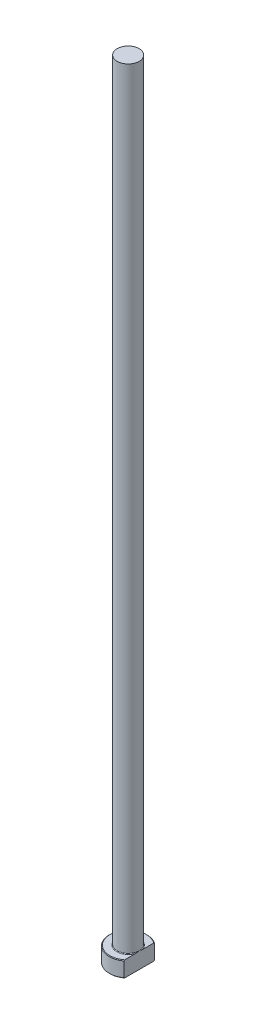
ISO-10303-21;
HEADER;
FILE_DESCRIPTION(('STEP AP214'),'2;1');
FILE_NAME('part.step','',(''),(''),'','','');
FILE_SCHEMA(('AUTOMOTIVE_DESIGN { 1 0 10303 214 1 1 1 1 }'));
ENDSEC;
DATA;
#1=APPLICATION_CONTEXT('core data for automotive mechanical design processes');
#2=APPLICATION_PROTOCOL_DEFINITION('international standard','automotive_design',2000,#1);
#3=PRODUCT_CONTEXT('',#1,'mechanical');
#4=PRODUCT('Part','Part','',(#3));
#5=PRODUCT_RELATED_PRODUCT_CATEGORY('part','',(#4));
#6=PRODUCT_DEFINITION_FORMATION('','',#4);
#7=PRODUCT_DEFINITION_CONTEXT('part definition',#1,'design');
#8=PRODUCT_DEFINITION('design','',#6,#7);
#9=PRODUCT_DEFINITION_SHAPE('','',#8);
#10=(LENGTH_UNIT() NAMED_UNIT(*) SI_UNIT(.MILLI.,.METRE.));
#11=(NAMED_UNIT(*) PLANE_ANGLE_UNIT() SI_UNIT($,.RADIAN.));
#12=(NAMED_UNIT(*) SI_UNIT($,.STERADIAN.) SOLID_ANGLE_UNIT());
#13=UNCERTAINTY_MEASURE_WITH_UNIT(LENGTH_MEASURE(1.E-05),#10,'distance_accuracy_value','');
#14=(GEOMETRIC_REPRESENTATION_CONTEXT(3) GLOBAL_UNCERTAINTY_ASSIGNED_CONTEXT((#13)) GLOBAL_UNIT_ASSIGNED_CONTEXT((#10,
#11,#12)) REPRESENTATION_CONTEXT('',''));
#15=CARTESIAN_POINT('',(0.,0.,0.));
#16=DIRECTION('',(0.,0.,1.));
#17=DIRECTION('',(1.,0.,0.));
#18=AXIS2_PLACEMENT_3D('',#15,#16,#17);
#19=CARTESIAN_POINT('',(0.,0.,0.));
#20=DIRECTION('',(0.,-1.,0.));
#21=DIRECTION('',(0.,0.,-1.));
#22=AXIS2_PLACEMENT_3D('',#19,#20,#21);
#23=PLANE('',#22);
#24=CARTESIAN_POINT('',(0.,0.,0.));
#25=DIRECTION('',(0.,-1.,0.));
#26=DIRECTION('',(0.,0.,-1.));
#27=AXIS2_PLACEMENT_3D('',#24,#25,#26);
#28=CIRCLE('',#27,5.79999999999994);
#29=CARTESIAN_POINT('',(3.49999999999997,0.,4.62493243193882));
#30=VERTEX_POINT('',#29);
#31=CARTESIAN_POINT('',(3.49999999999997,0.,-4.62493243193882));
#32=VERTEX_POINT('',#31);
#33=EDGE_CURVE('E98',#30,#32,#28,.T.);
#34=ORIENTED_EDGE('',*,*,#33,.T.);
#35=DIRECTION('',(0.,0.,1.));
#36=VECTOR('',#35,1.);
#37=CARTESIAN_POINT('',(3.49999999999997,0.,-4.87339717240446));
#38=LINE('',#37,#36);
#39=EDGE_CURVE('E83',#32,#30,#38,.T.);
#40=ORIENTED_EDGE('',*,*,#39,.T.);
#41=EDGE_LOOP('',(#34,#40));
#42=FACE_BOUND('',#41,.T.);
#43=ADVANCED_FACE('F32',(#42),#23,.T.);
#44=CARTESIAN_POINT('',(0.,259.958771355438,0.));
#45=DIRECTION('',(0.,1.,0.));
#46=DIRECTION('',(0.,0.,1.));
#47=AXIS2_PLACEMENT_3D('',#44,#45,#46);
#48=CYLINDRICAL_SURFACE('',#47,5.99999999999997);
#49=CARTESIAN_POINT('',(0.,4.80000000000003,0.));
#50=DIRECTION('',(0.,1.,0.));
#51=DIRECTION('',(0.,0.,1.));
#52=AXIS2_PLACEMENT_3D('',#49,#50,#51);
#53=CIRCLE('',#52,5.99999999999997);
#54=CARTESIAN_POINT('',(3.49999999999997,4.80000000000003,4.87339717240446));
#55=VERTEX_POINT('',#54);
#56=CARTESIAN_POINT('',(3.49999999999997,4.80000000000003,-4.87339717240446));
#57=VERTEX_POINT('',#56);
#58=EDGE_CURVE('E104',#55,#57,#53,.F.);
#59=ORIENTED_EDGE('',*,*,#58,.T.);
#60=DIRECTION('',(0.,-1.,0.));
#61=VECTOR('',#60,1.);
#62=CARTESIAN_POINT('',(3.49999999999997,250.,-4.87339717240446));
#63=LINE('',#62,#61);
#64=CARTESIAN_POINT('',(3.49999999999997,0.200000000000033,-4.87339717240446));
#65=VERTEX_POINT('',#64);
#66=EDGE_CURVE('E183',#57,#65,#63,.T.);
#67=ORIENTED_EDGE('',*,*,#66,.T.);
#68=CARTESIAN_POINT('',(0.,0.200000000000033,0.));
#69=DIRECTION('',(0.,-1.,0.));
#70=DIRECTION('',(0.,0.,-1.));
#71=AXIS2_PLACEMENT_3D('',#68,#69,#70);
#72=CIRCLE('',#71,5.99999999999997);
#73=CARTESIAN_POINT('',(3.49999999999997,0.200000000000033,4.87339717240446));
#74=VERTEX_POINT('',#73);
#75=EDGE_CURVE('E100',#65,#74,#72,.F.);
#76=ORIENTED_EDGE('',*,*,#75,.T.);
#77=DIRECTION('',(0.,-1.,0.));
#78=VECTOR('',#77,1.);
#79=CARTESIAN_POINT('',(3.49999999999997,250.,4.87339717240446));
#80=LINE('',#79,#78);
#81=EDGE_CURVE('E93',#55,#74,#80,.T.);
#82=ORIENTED_EDGE('',*,*,#81,.F.);
#83=EDGE_LOOP('',(#59,#67,#76,#82));
#84=FACE_BOUND('',#83,.T.);
#85=ADVANCED_FACE('F158',(#84),#48,.T.);
#86=CARTESIAN_POINT('',(-5.99999999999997,5.,0.));
#87=DIRECTION('',(0.,1.,0.));
#88=DIRECTION('',(0.,0.,1.));
#89=AXIS2_PLACEMENT_3D('',#86,#87,#88);
#90=PLANE('',#89);
#91=CARTESIAN_POINT('',(0.,5.,0.));
#92=DIRECTION('',(0.,1.,0.));
#93=DIRECTION('',(0.,0.,1.));
#94=AXIS2_PLACEMENT_3D('',#91,#92,#93);
#95=CIRCLE('',#94,5.79999999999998);
#96=CARTESIAN_POINT('',(3.49999999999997,5.,-4.62493243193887));
#97=VERTEX_POINT('',#96);
#98=CARTESIAN_POINT('',(3.49999999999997,5.,4.62493243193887));
#99=VERTEX_POINT('',#98);
#100=EDGE_CURVE('E178',#97,#99,#95,.T.);
#101=ORIENTED_EDGE('',*,*,#100,.T.);
#102=DIRECTION('',(0.,0.,-1.));
#103=VECTOR('',#102,1.);
#104=CARTESIAN_POINT('',(3.49999999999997,5.,0.));
#105=LINE('',#104,#103);
#106=CARTESIAN_POINT('',(3.49999999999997,4.99999999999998,1.19999999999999));
#107=VERTEX_POINT('',#106);
#108=EDGE_CURVE('E57',#99,#107,#105,.T.);
#109=ORIENTED_EDGE('',*,*,#108,.T.);
#110=CARTESIAN_POINT('',(0.,5.,0.));
#111=DIRECTION('',(0.,1.,0.));
#112=DIRECTION('',(0.,0.,1.));
#113=AXIS2_PLACEMENT_3D('',#110,#111,#112);
#114=CIRCLE('',#113,3.69999999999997);
#115=CARTESIAN_POINT('',(3.49999999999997,4.99999999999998,-1.19999999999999));
#116=VERTEX_POINT('',#115);
#117=EDGE_CURVE('E107',#107,#116,#114,.F.);
#118=ORIENTED_EDGE('',*,*,#117,.T.);
#119=EDGE_CURVE('E136',#116,#97,#105,.T.);
#120=ORIENTED_EDGE('',*,*,#119,.T.);
#121=EDGE_LOOP('',(#101,#109,#118,#120));
#122=FACE_BOUND('',#121,.T.);
#123=ADVANCED_FACE('F147',(#122),#90,.T.);
#124=CARTESIAN_POINT('',(0.,5.,0.));
#125=DIRECTION('',(0.,-1.,0.));
#126=DIRECTION('',(0.,0.,-1.));
#127=AXIS2_PLACEMENT_3D('',#124,#125,#126);
#128=CONICAL_SURFACE('',#127,5.79999999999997,0.785398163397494);
#129=ORIENTED_EDGE('',*,*,#58,.F.);
#130=CARTESIAN_POINT('',(3.49999999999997,-0.479658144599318,10.7229048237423));
#131=CARTESIAN_POINT('',(3.49999999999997,-0.304627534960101,10.5387821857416));
#132=CARTESIAN_POINT('',(3.49999999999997,-0.12982047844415,10.3544468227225));
#133=CARTESIAN_POINT('',(3.49999999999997,0.219261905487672,9.98527122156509));
#134=CARTESIAN_POINT('',(3.49999999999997,0.39353722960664,9.80043098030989));
#135=CARTESIAN_POINT('',(3.49999999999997,0.91559488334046,9.24486752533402));
#136=CARTESIAN_POINT('',(3.49999999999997,1.26244829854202,8.87327020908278));
#137=CARTESIAN_POINT('',(3.49999999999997,1.95718621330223,8.12195979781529));
#138=CARTESIAN_POINT('',(3.49999999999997,2.30502483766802,7.74220412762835));
#139=CARTESIAN_POINT('',(3.49999999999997,2.82267860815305,7.16898192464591));
#140=CARTESIAN_POINT('',(3.49999999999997,2.99451670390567,6.97734293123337));
#141=CARTESIAN_POINT('',(3.49999999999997,3.33649221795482,6.59255347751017));
#142=CARTESIAN_POINT('',(3.49999999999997,3.50662964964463,6.39940302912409));
#143=CARTESIAN_POINT('',(3.49999999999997,3.80984794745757,6.05127590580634));
#144=CARTESIAN_POINT('',(3.49999999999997,3.9433293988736,5.89664839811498));
#145=CARTESIAN_POINT('',(3.49999999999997,4.20861192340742,5.58595941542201));
#146=CARTESIAN_POINT('',(3.49999999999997,4.34041301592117,5.42989795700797));
#147=CARTESIAN_POINT('',(3.49999999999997,4.60204886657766,5.11587234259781));
#148=CARTESIAN_POINT('',(3.49999999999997,4.73188156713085,4.9579064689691));
#149=CARTESIAN_POINT('',(3.49999999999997,4.98887681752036,4.63982145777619));
#150=CARTESIAN_POINT('',(3.49999999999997,5.11603946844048,4.47970240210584));
#151=CARTESIAN_POINT('',(3.49999999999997,5.36664013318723,4.15712646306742));
#152=CARTESIAN_POINT('',(3.49999999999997,5.49008567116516,3.99467544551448));
#153=CARTESIAN_POINT('',(3.49999999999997,5.73245687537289,3.6663703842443));
#154=CARTESIAN_POINT('',(3.49999999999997,5.85138169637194,3.50051571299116));
#155=CARTESIAN_POINT('',(3.49999999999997,6.08288587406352,3.16479623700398));
#156=CARTESIAN_POINT('',(3.49999999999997,6.19547497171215,2.99493819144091));
#157=CARTESIAN_POINT('',(3.49999999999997,6.41208556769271,2.6498795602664));
#158=CARTESIAN_POINT('',(3.49999999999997,6.51611116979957,2.47468158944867));
#159=CARTESIAN_POINT('',(3.49999999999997,6.68667355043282,2.16371702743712));
#160=CARTESIAN_POINT('',(3.49999999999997,6.75595020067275,2.02946380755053));
#161=CARTESIAN_POINT('',(3.49999999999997,6.88572771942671,1.75668071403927));
#162=CARTESIAN_POINT('',(3.49999999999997,6.9462264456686,1.61814980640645));
#163=CARTESIAN_POINT('',(3.49999999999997,7.05535730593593,1.33751093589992));
#164=CARTESIAN_POINT('',(3.49999999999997,7.10406788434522,1.1954339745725));
#165=CARTESIAN_POINT('',(3.49999999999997,7.18698872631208,0.907101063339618));
#166=CARTESIAN_POINT('',(3.49999999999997,7.22121012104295,0.760848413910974));
#167=CARTESIAN_POINT('',(3.49999999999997,7.26487302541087,0.507831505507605));
#168=CARTESIAN_POINT('',(3.49999999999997,7.27861043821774,0.401805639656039));
#169=CARTESIAN_POINT('',(3.49999999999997,7.29650595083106,0.188947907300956));
#170=CARTESIAN_POINT('',(3.49999999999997,7.30066582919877,0.0821161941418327));
#171=CARTESIAN_POINT('',(3.49999999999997,7.29916002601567,-0.131492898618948));
#172=CARTESIAN_POINT('',(3.49999999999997,7.29349282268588,-0.238270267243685));
#173=CARTESIAN_POINT('',(3.49999999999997,7.27266406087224,-0.450895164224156));
#174=CARTESIAN_POINT('',(3.49999999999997,7.25750065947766,-0.556742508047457));
#175=CARTESIAN_POINT('',(3.49999999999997,7.21256554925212,-0.79858965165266));
#176=CARTESIAN_POINT('',(3.49999999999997,7.17976248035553,-0.934025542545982));
#177=CARTESIAN_POINT('',(3.49999999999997,7.10180151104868,-1.20127435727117));
#178=CARTESIAN_POINT('',(3.49999999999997,7.05663717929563,-1.33308535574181));
#179=CARTESIAN_POINT('',(3.49999999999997,6.95617548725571,-1.59358719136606));
#180=CARTESIAN_POINT('',(3.49999999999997,6.90082290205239,-1.72225647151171));
#181=CARTESIAN_POINT('',(3.49999999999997,6.81196782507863,-1.91246868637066));
#182=CARTESIAN_POINT('',(3.49999999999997,6.78138093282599,-1.97540288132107));
#183=CARTESIAN_POINT('',(3.49999999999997,6.71848328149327,-2.10040375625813));
#184=CARTESIAN_POINT('',(3.49999999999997,6.68617255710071,-2.16247045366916));
#185=CARTESIAN_POINT('',(3.49999999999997,6.59348343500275,-2.33529342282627));
#186=CARTESIAN_POINT('',(3.49999999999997,6.53139715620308,-2.44513435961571));
#187=CARTESIAN_POINT('',(3.49999999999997,6.40327495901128,-2.66249790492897));
#188=CARTESIAN_POINT('',(3.49999999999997,6.33723828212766,-2.77002006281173));
#189=CARTESIAN_POINT('',(3.49999999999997,6.20193961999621,-2.98310926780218));
#190=CARTESIAN_POINT('',(3.49999999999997,6.13267551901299,-3.08867496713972));
#191=CARTESIAN_POINT('',(3.49999999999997,5.99154722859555,-3.29805772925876));
#192=CARTESIAN_POINT('',(3.49999999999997,5.91968285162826,-3.40187466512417));
#193=CARTESIAN_POINT('',(3.49999999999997,5.70053198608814,-3.71160333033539));
#194=CARTESIAN_POINT('',(3.49999999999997,5.55004115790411,-3.91524708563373));
#195=CARTESIAN_POINT('',(3.49999999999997,5.24323373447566,-4.31793623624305));
#196=CARTESIAN_POINT('',(3.49999999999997,5.08691924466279,-4.5169832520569));
#197=CARTESIAN_POINT('',(3.49999999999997,4.76917008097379,-4.91272714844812));
#198=CARTESIAN_POINT('',(3.49999999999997,4.60771212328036,-5.10940527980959));
#199=CARTESIAN_POINT('',(3.49999999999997,4.28159454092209,-5.50010578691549));
#200=CARTESIAN_POINT('',(3.49999999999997,4.11693466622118,-5.69412795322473));
#201=CARTESIAN_POINT('',(3.49999999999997,3.7854437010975,-6.07977702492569));
#202=CARTESIAN_POINT('',(3.49999999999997,3.61861641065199,-6.27140720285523));
#203=CARTESIAN_POINT('',(3.49999999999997,3.28306967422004,-6.65300504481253));
#204=CARTESIAN_POINT('',(3.49999999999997,3.11435020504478,-6.84297268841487));
#205=CARTESIAN_POINT('',(3.49999999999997,2.66324311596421,-7.3468737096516));
#206=CARTESIAN_POINT('',(3.49999999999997,2.37954008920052,-7.65962881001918));
#207=CARTESIAN_POINT('',(3.49999999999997,1.80910784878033,-8.28261634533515));
#208=CARTESIAN_POINT('',(3.49999999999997,1.52237733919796,-8.59284759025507));
#209=CARTESIAN_POINT('',(3.49999999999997,0.950562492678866,-9.20727688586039));
#210=CARTESIAN_POINT('',(3.49999999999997,0.665505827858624,-9.51150072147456));
#211=CARTESIAN_POINT('',(3.49999999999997,0.0939335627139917,-10.1182972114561));
#212=CARTESIAN_POINT('',(3.49999999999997,-0.192581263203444,-10.4208705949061));
#213=CARTESIAN_POINT('',(3.49999999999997,-0.479658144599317,-10.7229048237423));
#214=B_SPLINE_CURVE_WITH_KNOTS('',3,(#130,#131,#132,#133,#134,#135,#136,#137,#138,#139,#140,
#141,#142,#143,#144,#145,#146,#147,#148,#149,#150,#151,#152,#153,#154,#155,#156,#157,#158,#159,
#160,#161,#162,#163,#164,#165,#166,#167,#168,#169,#170,#171,#172,#173,#174,#175,#176,#177,#178,
#179,#180,#181,#182,#183,#184,#185,#186,#187,#188,#189,#190,#191,#192,#193,#194,#195,#196,#197,
#198,#199,#200,#201,#202,#203,#204,#205,#206,#207,#208,#209,#210,#211,#212,#213),.UNSPECIFIED.,
.F.,.F.,(4,2,2,2,2,2,2,2,2,2,2,2,2,2,2,2,2,2,2,2,2,2,2,2,2,2,2,2,2,2,2,2,2,2,2,2,2,2,2,2,2,4),
(0.,0.762123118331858,1.52425095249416,3.04920520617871,4.59410962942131,5.36629689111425,
6.13847806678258,6.75128402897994,7.36408291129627,7.97748343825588,8.59086070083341,
9.20289910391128,9.81505138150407,10.4262352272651,11.0371244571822,11.4901076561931,
11.94320122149,12.393191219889,12.842834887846,13.1631796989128,13.4834650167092,
13.8037999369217,14.1241970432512,14.5415079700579,14.9590364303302,15.3788985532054,
15.5887982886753,15.7986938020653,16.1771020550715,16.5555831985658,16.9343160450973,
17.3130762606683,18.0725457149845,18.8317432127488,19.5950831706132,20.3584829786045,
21.1206884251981,21.88290322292,23.1496528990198,24.4169687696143,25.6676760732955,
26.9177769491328),.UNSPECIFIED.);
#215=EDGE_CURVE('E135',#55,#99,#214,.T.);
#216=ORIENTED_EDGE('',*,*,#215,.T.);
#217=ORIENTED_EDGE('',*,*,#100,.F.);
#218=EDGE_CURVE('E127',#97,#57,#214,.T.);
#219=ORIENTED_EDGE('',*,*,#218,.T.);
#220=EDGE_LOOP('',(#129,#216,#217,#219));
#221=FACE_BOUND('',#220,.T.);
#222=ADVANCED_FACE('F143',(#221),#128,.T.);
#223=CARTESIAN_POINT('',(0.,0.200000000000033,0.));
#224=DIRECTION('',(0.,1.,0.));
#225=DIRECTION('',(0.,0.,1.));
#226=AXIS2_PLACEMENT_3D('',#223,#224,#225);
#227=CONICAL_SURFACE('',#226,5.99999999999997,0.785398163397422);
#228=ORIENTED_EDGE('',*,*,#75,.F.);
#229=CARTESIAN_POINT('',(3.49999999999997,5.47965814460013,-10.7229048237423));
#230=CARTESIAN_POINT('',(3.49999999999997,5.3046275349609,-10.5387821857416));
#231=CARTESIAN_POINT('',(3.49999999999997,5.12982047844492,-10.3544468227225));
#232=CARTESIAN_POINT('',(3.49999999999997,4.78073809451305,-9.9852712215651));
#233=CARTESIAN_POINT('',(3.49999999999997,4.60646277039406,-9.80043098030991));
#234=CARTESIAN_POINT('',(3.49999999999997,4.08440511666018,-9.24486752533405));
#235=CARTESIAN_POINT('',(3.49999999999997,3.73755170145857,-8.87327020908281));
#236=CARTESIAN_POINT('',(3.49999999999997,3.04281378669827,-8.12195979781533));
#237=CARTESIAN_POINT('',(3.49999999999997,2.69497516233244,-7.74220412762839));
#238=CARTESIAN_POINT('',(3.49999999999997,2.17732139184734,-7.16898192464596));
#239=CARTESIAN_POINT('',(3.49999999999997,2.0054832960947,-6.97734293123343));
#240=CARTESIAN_POINT('',(3.49999999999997,1.66350778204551,-6.59255347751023));
#241=CARTESIAN_POINT('',(3.49999999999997,1.49337035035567,-6.39940302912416));
#242=CARTESIAN_POINT('',(3.49999999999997,1.1901520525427,-6.05127590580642));
#243=CARTESIAN_POINT('',(3.49999999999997,1.05667060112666,-5.89664839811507));
#244=CARTESIAN_POINT('',(3.49999999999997,0.791388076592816,-5.58595941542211));
#245=CARTESIAN_POINT('',(3.49999999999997,0.659586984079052,-5.42989795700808));
#246=CARTESIAN_POINT('',(3.49999999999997,0.397951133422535,-5.11587234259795));
#247=CARTESIAN_POINT('',(3.49999999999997,0.26811843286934,-4.95790646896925));
#248=CARTESIAN_POINT('',(3.49999999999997,0.0111231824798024,-4.63982145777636));
#249=CARTESIAN_POINT('',(3.49999999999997,-0.116039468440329,-4.47970240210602));
#250=CARTESIAN_POINT('',(3.49999999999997,-0.366640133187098,-4.15712646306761));
#251=CARTESIAN_POINT('',(3.49999999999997,-0.490085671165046,-3.99467544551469));
#252=CARTESIAN_POINT('',(3.49999999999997,-0.7324568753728,-3.66637038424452));
#253=CARTESIAN_POINT('',(3.49999999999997,-0.851381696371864,-3.50051571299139));
#254=CARTESIAN_POINT('',(3.49999999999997,-1.08288587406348,-3.16479623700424));
#255=CARTESIAN_POINT('',(3.49999999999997,-1.19547497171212,-2.99493819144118));
#256=CARTESIAN_POINT('',(3.49999999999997,-1.41208556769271,-2.64987956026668));
#257=CARTESIAN_POINT('',(3.49999999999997,-1.51611116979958,-2.47468158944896));
#258=CARTESIAN_POINT('',(3.49999999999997,-1.68667355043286,-2.16371702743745));
#259=CARTESIAN_POINT('',(3.49999999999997,-1.7559502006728,-2.02946380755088));
#260=CARTESIAN_POINT('',(3.49999999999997,-1.88572771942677,-1.75668071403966));
#261=CARTESIAN_POINT('',(3.49999999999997,-1.94622644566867,-1.61814980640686));
#262=CARTESIAN_POINT('',(3.49999999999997,-2.05535730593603,-1.33751093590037));
#263=CARTESIAN_POINT('',(3.49999999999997,-2.10406788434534,-1.19543397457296));
#264=CARTESIAN_POINT('',(3.49999999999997,-2.18698872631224,-0.907101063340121));
#265=CARTESIAN_POINT('',(3.49999999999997,-2.22121012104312,-0.760848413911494));
#266=CARTESIAN_POINT('',(3.49999999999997,-2.26487302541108,-0.507831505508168));
#267=CARTESIAN_POINT('',(3.49999999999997,-2.27861043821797,-0.401805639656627));
#268=CARTESIAN_POINT('',(3.49999999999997,-2.29650595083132,-0.188947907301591));
#269=CARTESIAN_POINT('',(3.49999999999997,-2.30066582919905,-0.0821161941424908));
#270=CARTESIAN_POINT('',(3.49999999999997,-2.299160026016,0.131492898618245));
#271=CARTESIAN_POINT('',(3.49999999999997,-2.29349282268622,0.238270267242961));
#272=CARTESIAN_POINT('',(3.49999999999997,-2.27266406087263,0.450895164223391));
#273=CARTESIAN_POINT('',(3.49999999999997,-2.25750065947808,0.556742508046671));
#274=CARTESIAN_POINT('',(3.49999999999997,-2.2125655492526,0.798589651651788));
#275=CARTESIAN_POINT('',(3.49999999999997,-2.17976248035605,0.934025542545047));
#276=CARTESIAN_POINT('',(3.49999999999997,-2.10180151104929,1.20127435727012));
#277=CARTESIAN_POINT('',(3.49999999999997,-2.05663717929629,1.3330853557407));
#278=CARTESIAN_POINT('',(3.49999999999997,-1.95617548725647,1.59358719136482));
#279=CARTESIAN_POINT('',(3.49999999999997,-1.9008229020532,1.72225647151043));
#280=CARTESIAN_POINT('',(3.49999999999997,-1.81196782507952,1.91246868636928));
#281=CARTESIAN_POINT('',(3.49999999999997,-1.7813809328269,1.97540288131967));
#282=CARTESIAN_POINT('',(3.49999999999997,-1.71848328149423,2.10040375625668));
#283=CARTESIAN_POINT('',(3.49999999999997,-1.6861725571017,2.16247045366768));
#284=CARTESIAN_POINT('',(3.49999999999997,-1.59348343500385,2.33529342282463));
#285=CARTESIAN_POINT('',(3.49999999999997,-1.53139715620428,2.44513435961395));
#286=CARTESIAN_POINT('',(3.49999999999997,-1.40327495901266,2.66249790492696));
#287=CARTESIAN_POINT('',(3.49999999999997,-1.33723828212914,2.7700200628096));
#288=CARTESIAN_POINT('',(3.49999999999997,-1.20193961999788,2.98310926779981));
#289=CARTESIAN_POINT('',(3.49999999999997,-1.13267551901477,3.08867496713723));
#290=CARTESIAN_POINT('',(3.49999999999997,-0.99154722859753,3.29805772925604));
#291=CARTESIAN_POINT('',(3.49999999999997,-0.919682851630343,3.40187466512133));
#292=CARTESIAN_POINT('',(3.49999999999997,-0.700531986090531,3.71160333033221));
#293=CARTESIAN_POINT('',(3.49999999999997,-0.550041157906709,3.91524708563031));
#294=CARTESIAN_POINT('',(3.49999999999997,-0.243233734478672,4.31793623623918));
#295=CARTESIAN_POINT('',(3.49999999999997,-0.0869192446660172,4.5169832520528));
#296=CARTESIAN_POINT('',(3.49999999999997,0.230829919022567,4.91272714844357));
#297=CARTESIAN_POINT('',(3.49999999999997,0.39228787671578,5.10940527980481));
#298=CARTESIAN_POINT('',(3.49999999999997,0.718405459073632,5.50010578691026));
#299=CARTESIAN_POINT('',(3.49999999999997,0.883065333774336,5.69412795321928));
#300=CARTESIAN_POINT('',(3.49999999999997,1.21455629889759,6.07977702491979));
#301=CARTESIAN_POINT('',(3.49999999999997,1.3813835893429,6.2714072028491));
#302=CARTESIAN_POINT('',(3.49999999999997,1.71693032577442,6.65300504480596));
#303=CARTESIAN_POINT('',(3.49999999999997,1.88564979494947,6.84297268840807));
#304=CARTESIAN_POINT('',(3.49999999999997,2.33675688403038,7.34687370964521));
#305=CARTESIAN_POINT('',(3.49999999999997,2.62045991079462,7.6596288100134));
#306=CARTESIAN_POINT('',(3.49999999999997,3.19089215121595,8.28261634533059));
#307=CARTESIAN_POINT('',(3.49999999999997,3.47762266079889,8.59284759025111));
#308=CARTESIAN_POINT('',(3.49999999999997,4.04943750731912,9.20727688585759));
#309=CARTESIAN_POINT('',(3.49999999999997,4.33449417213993,9.51150072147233));
#310=CARTESIAN_POINT('',(3.49999999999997,4.90606643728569,10.118297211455));
#311=CARTESIAN_POINT('',(3.49999999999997,5.19258126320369,10.4208705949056));
#312=CARTESIAN_POINT('',(3.49999999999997,5.47965814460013,10.7229048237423));
#313=B_SPLINE_CURVE_WITH_KNOTS('',3,(#229,#230,#231,#232,#233,#234,#235,#236,#237,#238,#239,
#240,#241,#242,#243,#244,#245,#246,#247,#248,#249,#250,#251,#252,#253,#254,#255,#256,#257,#258,
#259,#260,#261,#262,#263,#264,#265,#266,#267,#268,#269,#270,#271,#272,#273,#274,#275,#276,#277,
#278,#279,#280,#281,#282,#283,#284,#285,#286,#287,#288,#289,#290,#291,#292,#293,#294,#295,#296,
#297,#298,#299,#300,#301,#302,#303,#304,#305,#306,#307,#308,#309,#310,#311,#312),.UNSPECIFIED.,
.F.,.F.,(4,2,2,2,2,2,2,2,2,2,2,2,2,2,2,2,2,2,2,2,2,2,2,2,2,2,2,2,2,2,2,2,2,2,2,2,2,2,2,2,2,4),
(0.,0.762123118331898,1.52425095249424,3.04920520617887,4.59410962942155,5.36629689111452,
6.13847806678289,6.75128402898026,7.36408291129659,7.9774834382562,8.59086070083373,
9.20289910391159,9.81505138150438,10.4262352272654,11.0371244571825,11.4901076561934,
11.9432012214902,12.3931912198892,12.8428348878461,13.1631796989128,13.4834650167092,
13.8037999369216,14.1241970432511,14.5415079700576,14.9590364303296,15.3788985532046,
15.5887982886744,15.7986938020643,16.1771020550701,16.5555831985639,16.9343160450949,
17.3130762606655,18.0725457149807,18.8317432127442,19.5950831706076,20.3584829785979,
21.1206884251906,21.8829032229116,23.1496528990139,24.4169687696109,25.6676760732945,
26.9177769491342),.UNSPECIFIED.);
#314=EDGE_CURVE('E86',#65,#32,#313,.T.);
#315=ORIENTED_EDGE('',*,*,#314,.T.);
#316=ORIENTED_EDGE('',*,*,#33,.F.);
#317=EDGE_CURVE('E89',#30,#74,#313,.T.);
#318=ORIENTED_EDGE('',*,*,#317,.T.);
#319=EDGE_LOOP('',(#228,#315,#316,#318));
#320=FACE_BOUND('',#319,.T.);
#321=ADVANCED_FACE('F97',(#320),#227,.T.);
#322=CARTESIAN_POINT('',(0.,5.19999999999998,0.));
#323=DIRECTION('',(0.,1.,0.));
#324=DIRECTION('',(0.,0.,1.));
#325=AXIS2_PLACEMENT_3D('',#322,#323,#324);
#326=TOROIDAL_SURFACE('',#325,3.69999999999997,0.2);
#327=CARTESIAN_POINT('',(3.49999999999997,5.19999999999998,0.));
#328=CARTESIAN_POINT('',(3.49999999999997,5.20000050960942,9.98094828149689E-11));
#329=CARTESIAN_POINT('',(3.49999999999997,5.20000101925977,-2.13486746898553E-07));
#330=CARTESIAN_POINT('',(3.49999999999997,5.20000196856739,-7.957591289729E-07));
#331=CARTESIAN_POINT('',(3.49999999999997,5.20000239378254,-1.17925839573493E-06));
#332=CARTESIAN_POINT('',(3.49999999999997,5.20000328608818,-2.10014972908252E-06));
#333=CARTESIAN_POINT('',(3.49999999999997,5.20000373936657,-2.65249908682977E-06));
#334=CARTESIAN_POINT('',(3.49999999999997,5.20000454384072,-3.79112889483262E-06));
#335=CARTESIAN_POINT('',(3.49999999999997,5.20000489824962,-4.37533521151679E-06));
#336=CARTESIAN_POINT('',(3.49999999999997,5.20000623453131,-6.66270059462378E-06));
#337=CARTESIAN_POINT('',(3.49999999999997,5.20000714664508,-8.40961025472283E-06));
#338=CARTESIAN_POINT('',(3.49999999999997,5.20000862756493,-1.18496824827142E-05));
#339=CARTESIAN_POINT('',(3.49999999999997,5.20000922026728,-1.35329548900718E-05));
#340=CARTESIAN_POINT('',(3.49999999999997,5.20001174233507,-2.07268950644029E-05));
#341=CARTESIAN_POINT('',(3.49999999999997,5.20001365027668,-2.62477536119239E-05));
#342=CARTESIAN_POINT('',(3.49999999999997,5.20001642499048,-3.66274572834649E-05));
#343=CARTESIAN_POINT('',(3.49999999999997,5.20001740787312,-4.14549355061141E-05));
#344=CARTESIAN_POINT('',(3.49999999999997,5.20002462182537,-7.75352102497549E-05));
#345=CARTESIAN_POINT('',(3.49999999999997,5.20003014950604,-0.000108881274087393));
#346=CARTESIAN_POINT('',(3.49999999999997,5.20005434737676,-0.000233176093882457));
#347=CARTESIAN_POINT('',(3.49999999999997,5.20007737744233,-0.000325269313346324));
#348=CARTESIAN_POINT('',(3.49999999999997,5.20016742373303,-0.000691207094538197));
#349=CARTESIAN_POINT('',(3.49999999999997,5.20023166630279,-0.000965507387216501));
#350=CARTESIAN_POINT('',(3.49999999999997,5.20048971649,-0.0020594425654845));
#351=CARTESIAN_POINT('',(3.49999999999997,5.20068705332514,-0.00287847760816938));
#352=CARTESIAN_POINT('',(3.49999999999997,5.20150941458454,-0.00630050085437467));
#353=CARTESIAN_POINT('',(3.49999999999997,5.20212997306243,-0.00890424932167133));
#354=CARTESIAN_POINT('',(3.49999999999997,5.20703918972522,-0.0294912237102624));
#355=CARTESIAN_POINT('',(3.49999999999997,5.21134300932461,-0.0474719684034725));
#356=CARTESIAN_POINT('',(3.49999999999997,5.21975360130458,-0.0827191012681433));
#357=CARTESIAN_POINT('',(3.49999999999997,5.22386136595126,-0.0999852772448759));
#358=CARTESIAN_POINT('',(3.49999999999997,5.2372401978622,-0.156405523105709));
#359=CARTESIAN_POINT('',(3.49999999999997,5.24645854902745,-0.195572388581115));
#360=CARTESIAN_POINT('',(3.49999999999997,5.26203234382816,-0.262828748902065));
#361=CARTESIAN_POINT('',(3.49999999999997,5.26845671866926,-0.290902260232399));
#362=CARTESIAN_POINT('',(3.49999999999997,5.28094671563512,-0.346379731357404));
#363=CARTESIAN_POINT('',(3.49999999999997,5.28701730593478,-0.373782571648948));
#364=CARTESIAN_POINT('',(3.49999999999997,5.30077691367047,-0.437211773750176));
#365=CARTESIAN_POINT('',(3.49999999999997,5.3083789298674,-0.473257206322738));
#366=CARTESIAN_POINT('',(3.49999999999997,5.32309409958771,-0.545736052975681));
#367=CARTESIAN_POINT('',(3.49999999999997,5.33020304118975,-0.582170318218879));
#368=CARTESIAN_POINT('',(3.49999999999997,5.35161649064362,-0.697757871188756));
#369=CARTESIAN_POINT('',(3.49999999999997,5.36463967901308,-0.777158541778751));
#370=CARTESIAN_POINT('',(3.49999999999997,5.3843837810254,-0.92756184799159));
#371=CARTESIAN_POINT('',(3.49999999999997,5.39165512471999,-0.998486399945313));
#372=CARTESIAN_POINT('',(3.49999999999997,5.3979989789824,-1.10437287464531));
#373=CARTESIAN_POINT('',(3.49999999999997,5.39936233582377,-1.13919451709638));
#374=CARTESIAN_POINT('',(3.49999999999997,5.40028946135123,-1.20885098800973));
#375=CARTESIAN_POINT('',(3.49999999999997,5.39985418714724,-1.24368579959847));
#376=CARTESIAN_POINT('',(3.49999999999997,5.39686573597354,-1.30963279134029));
#377=CARTESIAN_POINT('',(3.49999999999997,5.39453835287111,-1.34075403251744));
#378=CARTESIAN_POINT('',(3.49999999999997,5.38750048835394,-1.40298456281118));
#379=CARTESIAN_POINT('',(3.49999999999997,5.38277118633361,-1.43409178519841));
#380=CARTESIAN_POINT('',(3.49999999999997,5.37000596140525,-1.49609278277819));
#381=CARTESIAN_POINT('',(3.49999999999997,5.36193044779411,-1.52697933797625));
#382=CARTESIAN_POINT('',(3.49999999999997,5.34614337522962,-1.57192957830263));
#383=CARTESIAN_POINT('',(3.49999999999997,5.3402919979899,-1.5866404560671));
#384=CARTESIAN_POINT('',(3.49999999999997,5.32701491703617,-1.6153215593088));
#385=CARTESIAN_POINT('',(3.49999999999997,5.31959341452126,-1.6292936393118));
#386=CARTESIAN_POINT('',(3.49999999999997,5.30547056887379,-1.65150372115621));
#387=CARTESIAN_POINT('',(3.49999999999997,5.29934759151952,-1.6601058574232));
#388=CARTESIAN_POINT('',(3.49999999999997,5.28595656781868,-1.67637400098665));
#389=CARTESIAN_POINT('',(3.49999999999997,5.27869146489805,-1.68404232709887));
#390=CARTESIAN_POINT('',(3.49999999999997,5.26587375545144,-1.69518467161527));
#391=CARTESIAN_POINT('',(3.49999999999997,5.26073958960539,-1.69913647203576));
#392=CARTESIAN_POINT('',(3.49999999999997,5.24994100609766,-1.70624293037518));
#393=CARTESIAN_POINT('',(3.49999999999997,5.24427723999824,-1.70939855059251));
#394=CARTESIAN_POINT('',(3.49999999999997,5.23351378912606,-1.71418736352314));
#395=CARTESIAN_POINT('',(3.49999999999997,5.22849079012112,-1.71599090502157));
#396=CARTESIAN_POINT('',(3.49999999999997,5.21821361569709,-1.71873268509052));
#397=CARTESIAN_POINT('',(3.49999999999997,5.21295968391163,-1.71967181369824));
#398=CARTESIAN_POINT('',(3.49999999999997,5.20234462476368,-1.72059432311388));
#399=CARTESIAN_POINT('',(3.49999999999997,5.19698314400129,-1.72057373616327));
#400=CARTESIAN_POINT('',(3.49999999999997,5.18635093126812,-1.71956893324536));
#401=CARTESIAN_POINT('',(3.49999999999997,5.18108024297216,-1.71858426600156));
#402=CARTESIAN_POINT('',(3.49999999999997,5.17106869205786,-1.71582968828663));
#403=CARTESIAN_POINT('',(3.49999999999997,5.16631466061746,-1.71410641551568));
#404=CARTESIAN_POINT('',(3.49999999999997,5.15709718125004,-1.71001459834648));
#405=CARTESIAN_POINT('',(3.49999999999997,5.15263381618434,-1.70764587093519));
#406=CARTESIAN_POINT('',(3.49999999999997,5.14110717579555,-1.70060771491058));
#407=CARTESIAN_POINT('',(3.49999999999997,5.13433222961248,-1.69546710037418));
#408=CARTESIAN_POINT('',(3.49999999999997,5.12164557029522,-1.68420869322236));
#409=CARTESIAN_POINT('',(3.49999999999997,5.11573697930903,-1.67808752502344));
#410=CARTESIAN_POINT('',(3.49999999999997,5.10028952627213,-1.66008531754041));
#411=CARTESIAN_POINT('',(3.49999999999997,5.09159238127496,-1.64748936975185));
#412=CARTESIAN_POINT('',(3.49999999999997,5.07604019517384,-1.62125022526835));
#413=CARTESIAN_POINT('',(3.49999999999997,5.06918749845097,-1.60760572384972));
#414=CARTESIAN_POINT('',(3.49999999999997,5.05635908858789,-1.57851190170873));
#415=CARTESIAN_POINT('',(3.49999999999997,5.05050870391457,-1.56300807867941));
#416=CARTESIAN_POINT('',(3.49999999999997,5.04009412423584,-1.53156759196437));
#417=CARTESIAN_POINT('',(3.49999999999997,5.03553147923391,-1.51563043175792));
#418=CARTESIAN_POINT('',(3.49999999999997,5.02331191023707,-1.46712048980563));
#419=CARTESIAN_POINT('',(3.49999999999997,5.01724153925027,-1.4341495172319));
#420=CARTESIAN_POINT('',(3.49999999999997,5.00883071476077,-1.37348993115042));
#421=CARTESIAN_POINT('',(3.49999999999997,5.00603148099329,-1.34585663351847));
#422=CARTESIAN_POINT('',(3.49999999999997,5.00204762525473,-1.29046925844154));
#423=CARTESIAN_POINT('',(3.49999999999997,5.00086336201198,-1.26271515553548));
#424=CARTESIAN_POINT('',(3.49999999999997,4.99925913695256,-1.17922229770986));
#425=CARTESIAN_POINT('',(3.49999999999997,5.00080993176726,-1.1234488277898));
#426=CARTESIAN_POINT('',(3.49999999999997,5.00738569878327,-1.01528124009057));
#427=CARTESIAN_POINT('',(3.49999999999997,5.01221131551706,-0.962872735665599));
#428=CARTESIAN_POINT('',(3.49999999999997,5.02425367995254,-0.858750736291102));
#429=CARTESIAN_POINT('',(3.49999999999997,5.03145152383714,-0.807035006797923));
#430=CARTESIAN_POINT('',(3.49999999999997,5.04786442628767,-0.702500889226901));
#431=CARTESIAN_POINT('',(3.49999999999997,5.05712869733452,-0.649690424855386));
#432=CARTESIAN_POINT('',(3.49999999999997,5.07730630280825,-0.542969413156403));
#433=CARTESIAN_POINT('',(3.49999999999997,5.08825618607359,-0.489065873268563));
#434=CARTESIAN_POINT('',(3.49999999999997,5.10770336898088,-0.397738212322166));
#435=CARTESIAN_POINT('',(3.49999999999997,5.11594150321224,-0.360258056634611));
#436=CARTESIAN_POINT('',(3.49999999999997,5.1326812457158,-0.285797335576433));
#437=CARTESIAN_POINT('',(3.49999999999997,5.14117887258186,-0.248815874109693));
#438=CARTESIAN_POINT('',(3.49999999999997,5.15740628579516,-0.179140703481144));
#439=CARTESIAN_POINT('',(3.49999999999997,5.16511243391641,-0.146441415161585));
#440=CARTESIAN_POINT('',(3.49999999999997,5.18096853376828,-0.0796648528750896));
#441=CARTESIAN_POINT('',(3.49999999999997,5.18912333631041,-0.045588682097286));
#442=CARTESIAN_POINT('',(3.49999999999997,5.19787118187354,-0.00889903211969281));
#443=CARTESIAN_POINT('',(3.49999999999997,5.19849305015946,-0.00629009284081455));
#444=CARTESIAN_POINT('',(3.49999999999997,5.19931571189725,-0.00286690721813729));
#445=CARTESIAN_POINT('',(3.49999999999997,5.19951207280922,-0.0020519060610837));
#446=CARTESIAN_POINT('',(3.49999999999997,5.19976893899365,-0.0009629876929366));
#447=CARTESIAN_POINT('',(3.49999999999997,5.19983295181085,-0.00068966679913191));
#448=CARTESIAN_POINT('',(3.49999999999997,5.19992272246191,-0.000324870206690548));
#449=CARTESIAN_POINT('',(3.49999999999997,5.19994571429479,-0.000232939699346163));
#450=CARTESIAN_POINT('',(3.49999999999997,5.19996987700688,-0.000108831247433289));
#451=CARTESIAN_POINT('',(3.49999999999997,5.19997540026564,-7.75074375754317E-05));
#452=CARTESIAN_POINT('',(3.49999999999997,5.19998260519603,-4.1449950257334E-05));
#453=CARTESIAN_POINT('',(3.49999999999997,5.19998358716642,-3.66236562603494E-05));
#454=CARTESIAN_POINT('',(3.49999999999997,5.19998635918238,-2.62464271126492E-05));
#455=CARTESIAN_POINT('',(3.49999999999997,5.19998826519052,-2.07267962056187E-05));
#456=CARTESIAN_POINT('',(3.49999999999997,5.19999078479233,-1.353414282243E-05));
#457=CARTESIAN_POINT('',(3.49999999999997,5.19999137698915,-1.18509583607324E-05));
#458=CARTESIAN_POINT('',(3.49999999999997,5.19999285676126,-8.4109834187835E-06));
#459=CARTESIAN_POINT('',(3.49999999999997,5.19999376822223,-6.66407126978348E-06));
#460=CARTESIAN_POINT('',(3.49999999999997,5.19999510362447,-4.37661194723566E-06));
#461=CARTESIAN_POINT('',(3.49999999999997,5.19999545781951,-3.79235333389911E-06));
#462=CARTESIAN_POINT('',(3.49999999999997,5.19999626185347,-2.65358032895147E-06));
#463=CARTESIAN_POINT('',(3.49999999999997,5.19999671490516,-2.10113839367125E-06));
#464=CARTESIAN_POINT('',(3.49999999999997,5.1999976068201,-1.18003190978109E-06));
#465=CARTESIAN_POINT('',(3.49999999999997,5.19999803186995,-7.96418762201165E-07));
#466=CARTESIAN_POINT('',(3.49999999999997,5.19999898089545,-2.13855187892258E-07));
#467=CARTESIAN_POINT('',(3.49999999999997,5.19999949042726,-9.98022935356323E-11));
#468=CARTESIAN_POINT('',(3.49999999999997,5.19999999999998,0.));
#469=B_SPLINE_CURVE_WITH_KNOTS('',3,(#327,#328,#329,#330,#331,#332,#333,#334,#335,#336,#337,
#338,#339,#340,#341,#342,#343,#344,#345,#346,#347,#348,#349,#350,#351,#352,#353,#354,#355,#356,
#357,#358,#359,#360,#361,#362,#363,#364,#365,#366,#367,#368,#369,#370,#371,#372,#373,#374,#375,
#376,#377,#378,#379,#380,#381,#382,#383,#384,#385,#386,#387,#388,#389,#390,#391,#392,#393,#394,
#395,#396,#397,#398,#399,#400,#401,#402,#403,#404,#405,#406,#407,#408,#409,#410,#411,#412,#413,
#414,#415,#416,#417,#418,#419,#420,#421,#422,#423,#424,#425,#426,#427,#428,#429,#430,#431,#432,
#433,#434,#435,#436,#437,#438,#439,#440,#441,#442,#443,#444,#445,#446,#447,#448,#449,#450,#451,
#452,#453,#454,#455,#456,#457,#458,#459,#460,#461,#462,#463,#464,#465,#466,#467,#468),
.UNSPECIFIED.,.T.,.F.,(4,2,2,2,2,2,2,2,2,2,2,2,2,2,2,2,2,2,2,2,2,2,2,2,2,2,2,2,2,2,2,2,2,2,2,2,
2,2,2,2,2,2,2,2,2,2,2,2,2,2,2,2,2,2,2,2,2,2,2,2,2,2,2,2,2,2,2,2,2,2,4),(0.,1.54778905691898E-06,
3.27068856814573E-06,5.40032147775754E-06,7.44938901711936E-06,1.3341290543E-05,
1.86900588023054E-05,3.61865044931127E-05,5.09488028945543E-05,0.000146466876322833,
0.000431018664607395,0.0012764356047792,0.00380354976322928,0.0118339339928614,
0.0672984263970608,0.120543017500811,0.24125328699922,0.327650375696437,0.411851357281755,
0.52236238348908,0.633723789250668,0.875007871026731,1.08869711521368,1.19320699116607,
1.29766126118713,1.39121331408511,1.4855099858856,1.58095571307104,1.62839133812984,
1.67570160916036,1.70731126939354,1.73884076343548,1.75822424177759,1.77758417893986,
1.79352969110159,1.80945876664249,1.82545370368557,1.84145613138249,1.8565700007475,
1.8716881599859,1.89705349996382,1.92250811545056,1.96816999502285,2.01388964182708,
2.06352392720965,2.11321770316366,2.21356505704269,2.29684564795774,2.3801447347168,
2.54733140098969,2.70515844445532,2.86175703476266,3.02258329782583,3.18758220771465,
3.30270498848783,3.41653913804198,3.51732480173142,3.62243689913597,3.63048332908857,
3.63299799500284,3.63384039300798,3.63412444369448,3.6342198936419,3.63423465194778,
3.63425214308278,3.63425749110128,3.63426338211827,3.63426543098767,3.63426756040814,
3.63426928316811,3.63427083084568),.UNSPECIFIED.);
#470=CARTESIAN_POINT('',(3.49999999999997,5.19999999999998,0.));
#471=VERTEX_POINT('',#470);
#472=EDGE_CURVE('E11',#116,#471,#469,.T.);
#473=ORIENTED_EDGE('',*,*,#472,.F.);
#474=ORIENTED_EDGE('',*,*,#117,.F.);
#475=CARTESIAN_POINT('',(3.49999999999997,5.19999999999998,0.));
#476=CARTESIAN_POINT('',(3.49999999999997,5.19999949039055,-9.98094430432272E-11));
#477=CARTESIAN_POINT('',(3.49999999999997,5.1999989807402,2.1348674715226E-07));
#478=CARTESIAN_POINT('',(3.49999999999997,5.19999803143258,7.95759129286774E-07));
#479=CARTESIAN_POINT('',(3.49999999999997,5.19999760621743,1.17925839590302E-06));
#480=CARTESIAN_POINT('',(3.49999999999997,5.19999671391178,2.10014972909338E-06));
#481=CARTESIAN_POINT('',(3.49999999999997,5.1999962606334,2.65249908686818E-06));
#482=CARTESIAN_POINT('',(3.49999999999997,5.19999545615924,3.79112889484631E-06));
#483=CARTESIAN_POINT('',(3.49999999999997,5.19999510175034,4.37533521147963E-06));
#484=CARTESIAN_POINT('',(3.49999999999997,5.19999376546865,6.66270059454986E-06));
#485=CARTESIAN_POINT('',(3.49999999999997,5.19999285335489,8.40961025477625E-06));
#486=CARTESIAN_POINT('',(3.49999999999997,5.19999137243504,1.18496824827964E-05));
#487=CARTESIAN_POINT('',(3.49999999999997,5.19999077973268,1.35329548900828E-05));
#488=CARTESIAN_POINT('',(3.49999999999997,5.19998825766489,2.07268950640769E-05));
#489=CARTESIAN_POINT('',(3.49999999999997,5.19998634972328,2.62477536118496E-05));
#490=CARTESIAN_POINT('',(3.49999999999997,5.19998357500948,3.66274572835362E-05));
#491=CARTESIAN_POINT('',(3.49999999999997,5.19998259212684,4.14549355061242E-05));
#492=CARTESIAN_POINT('',(3.49999999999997,5.1999753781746,7.75352102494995E-05));
#493=CARTESIAN_POINT('',(3.49999999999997,5.19996985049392,0.000108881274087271));
#494=CARTESIAN_POINT('',(3.49999999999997,5.1999456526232,0.000233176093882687));
#495=CARTESIAN_POINT('',(3.49999999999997,5.19992262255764,0.000325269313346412));
#496=CARTESIAN_POINT('',(3.49999999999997,5.19983257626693,0.000691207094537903));
#497=CARTESIAN_POINT('',(3.49999999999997,5.19976833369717,0.000965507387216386));
#498=CARTESIAN_POINT('',(3.49999999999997,5.19951028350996,0.00205944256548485));
#499=CARTESIAN_POINT('',(3.49999999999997,5.19931294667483,0.00287847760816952));
#500=CARTESIAN_POINT('',(3.49999999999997,5.19849058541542,0.00630050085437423));
#501=CARTESIAN_POINT('',(3.49999999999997,5.19787002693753,0.00890424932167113));
#502=CARTESIAN_POINT('',(3.49999999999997,5.19296081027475,0.0294912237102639));
#503=CARTESIAN_POINT('',(3.49999999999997,5.18865699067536,0.0474719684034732));
#504=CARTESIAN_POINT('',(3.49999999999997,5.18024639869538,0.0827191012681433));
#505=CARTESIAN_POINT('',(3.49999999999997,5.1761386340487,0.0999852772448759));
#506=CARTESIAN_POINT('',(3.49999999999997,5.16275980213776,0.15640552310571));
#507=CARTESIAN_POINT('',(3.49999999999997,5.15354145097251,0.195572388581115));
#508=CARTESIAN_POINT('',(3.49999999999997,5.1379676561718,0.262828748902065));
#509=CARTESIAN_POINT('',(3.49999999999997,5.13154328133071,0.290902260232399));
#510=CARTESIAN_POINT('',(3.49999999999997,5.11905328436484,0.346379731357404));
#511=CARTESIAN_POINT('',(3.49999999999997,5.11298269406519,0.373782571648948));
#512=CARTESIAN_POINT('',(3.49999999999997,5.09922308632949,0.437211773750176));
#513=CARTESIAN_POINT('',(3.49999999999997,5.09162107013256,0.473257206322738));
#514=CARTESIAN_POINT('',(3.49999999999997,5.07690590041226,0.545736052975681));
#515=CARTESIAN_POINT('',(3.49999999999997,5.06979695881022,0.582170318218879));
#516=CARTESIAN_POINT('',(3.49999999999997,5.04838350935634,0.697757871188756));
#517=CARTESIAN_POINT('',(3.49999999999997,5.03536032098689,0.777158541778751));
#518=CARTESIAN_POINT('',(3.49999999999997,5.01561621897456,0.92756184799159));
#519=CARTESIAN_POINT('',(3.49999999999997,5.00834487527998,0.998486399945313));
#520=CARTESIAN_POINT('',(3.49999999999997,5.00200102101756,1.10437287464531));
#521=CARTESIAN_POINT('',(3.49999999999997,5.00063766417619,1.13919451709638));
#522=CARTESIAN_POINT('',(3.49999999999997,4.99971053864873,1.20885098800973));
#523=CARTESIAN_POINT('',(3.49999999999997,5.00014581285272,1.24368579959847));
#524=CARTESIAN_POINT('',(3.49999999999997,5.00313426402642,1.30963279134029));
#525=CARTESIAN_POINT('',(3.49999999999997,5.00546164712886,1.34075403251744));
#526=CARTESIAN_POINT('',(3.49999999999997,5.01249951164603,1.40298456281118));
#527=CARTESIAN_POINT('',(3.49999999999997,5.01722881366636,1.43409178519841));
#528=CARTESIAN_POINT('',(3.49999999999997,5.02999403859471,1.49609278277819));
#529=CARTESIAN_POINT('',(3.49999999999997,5.03806955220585,1.52697933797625));
#530=CARTESIAN_POINT('',(3.49999999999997,5.05385662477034,1.57192957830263));
#531=CARTESIAN_POINT('',(3.49999999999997,5.05970800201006,1.5866404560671));
#532=CARTESIAN_POINT('',(3.49999999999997,5.0729850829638,1.6153215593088));
#533=CARTESIAN_POINT('',(3.49999999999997,5.0804065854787,1.6292936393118));
#534=CARTESIAN_POINT('',(3.49999999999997,5.09452943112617,1.65150372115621));
#535=CARTESIAN_POINT('',(3.49999999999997,5.10065240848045,1.6601058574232));
#536=CARTESIAN_POINT('',(3.49999999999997,5.11404343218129,1.67637400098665));
#537=CARTESIAN_POINT('',(3.49999999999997,5.12130853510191,1.68404232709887));
#538=CARTESIAN_POINT('',(3.49999999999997,5.13412624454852,1.69518467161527));
#539=CARTESIAN_POINT('',(3.49999999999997,5.13926041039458,1.69913647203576));
#540=CARTESIAN_POINT('',(3.49999999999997,5.1500589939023,1.70624293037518));
#541=CARTESIAN_POINT('',(3.49999999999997,5.15572276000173,1.70939855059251));
#542=CARTESIAN_POINT('',(3.49999999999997,5.1664862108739,1.71418736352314));
#543=CARTESIAN_POINT('',(3.49999999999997,5.17150920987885,1.71599090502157));
#544=CARTESIAN_POINT('',(3.49999999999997,5.18178638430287,1.71873268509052));
#545=CARTESIAN_POINT('',(3.49999999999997,5.18704031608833,1.71967181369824));
#546=CARTESIAN_POINT('',(3.49999999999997,5.19765537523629,1.72059432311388));
#547=CARTESIAN_POINT('',(3.49999999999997,5.20301685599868,1.72057373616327));
#548=CARTESIAN_POINT('',(3.49999999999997,5.21364906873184,1.71956893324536));
#549=CARTESIAN_POINT('',(3.49999999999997,5.21891975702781,1.71858426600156));
#550=CARTESIAN_POINT('',(3.49999999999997,5.22893130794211,1.71582968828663));
#551=CARTESIAN_POINT('',(3.49999999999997,5.23368533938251,1.71410641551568));
#552=CARTESIAN_POINT('',(3.49999999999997,5.24290281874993,1.71001459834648));
#553=CARTESIAN_POINT('',(3.49999999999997,5.24736618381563,1.70764587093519));
#554=CARTESIAN_POINT('',(3.49999999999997,5.25889282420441,1.70060771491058));
#555=CARTESIAN_POINT('',(3.49999999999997,5.26566777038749,1.69546710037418));
#556=CARTESIAN_POINT('',(3.49999999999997,5.27835442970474,1.68420869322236));
#557=CARTESIAN_POINT('',(3.49999999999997,5.28426302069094,1.67808752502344));
#558=CARTESIAN_POINT('',(3.49999999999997,5.29971047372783,1.66008531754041));
#559=CARTESIAN_POINT('',(3.49999999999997,5.30840761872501,1.64748936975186));
#560=CARTESIAN_POINT('',(3.49999999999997,5.32395980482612,1.62125022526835));
#561=CARTESIAN_POINT('',(3.49999999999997,5.33081250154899,1.60760572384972));
#562=CARTESIAN_POINT('',(3.49999999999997,5.34364091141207,1.57851190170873));
#563=CARTESIAN_POINT('',(3.49999999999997,5.34949129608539,1.56300807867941));
#564=CARTESIAN_POINT('',(3.49999999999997,5.35990587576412,1.53156759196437));
#565=CARTESIAN_POINT('',(3.49999999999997,5.36446852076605,1.51563043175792));
#566=CARTESIAN_POINT('',(3.49999999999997,5.37668808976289,1.46712048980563));
#567=CARTESIAN_POINT('',(3.49999999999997,5.3827584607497,1.4341495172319));
#568=CARTESIAN_POINT('',(3.49999999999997,5.3911692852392,1.37348993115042));
#569=CARTESIAN_POINT('',(3.49999999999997,5.39396851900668,1.34585663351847));
#570=CARTESIAN_POINT('',(3.49999999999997,5.39795237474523,1.29046925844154));
#571=CARTESIAN_POINT('',(3.49999999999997,5.39913663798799,1.26271515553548));
#572=CARTESIAN_POINT('',(3.49999999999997,5.40074086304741,1.17922229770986));
#573=CARTESIAN_POINT('',(3.49999999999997,5.3991900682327,1.1234488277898));
#574=CARTESIAN_POINT('',(3.49999999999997,5.39261430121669,1.01528124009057));
#575=CARTESIAN_POINT('',(3.49999999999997,5.3877886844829,0.9628727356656));
#576=CARTESIAN_POINT('',(3.49999999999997,5.37574632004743,0.858750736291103));
#577=CARTESIAN_POINT('',(3.49999999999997,5.36854847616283,0.807035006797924));
#578=CARTESIAN_POINT('',(3.49999999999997,5.3521355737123,0.702500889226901));
#579=CARTESIAN_POINT('',(3.49999999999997,5.34287130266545,0.649690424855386));
#580=CARTESIAN_POINT('',(3.49999999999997,5.32269369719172,0.542969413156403));
#581=CARTESIAN_POINT('',(3.49999999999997,5.31174381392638,0.489065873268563));
#582=CARTESIAN_POINT('',(3.49999999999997,5.29229663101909,0.397738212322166));
#583=CARTESIAN_POINT('',(3.49999999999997,5.28405849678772,0.360258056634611));
#584=CARTESIAN_POINT('',(3.49999999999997,5.26731875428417,0.285797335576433));
#585=CARTESIAN_POINT('',(3.49999999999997,5.2588211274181,0.248815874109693));
#586=CARTESIAN_POINT('',(3.49999999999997,5.24259371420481,0.179140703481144));
#587=CARTESIAN_POINT('',(3.49999999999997,5.23488756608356,0.146441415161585));
#588=CARTESIAN_POINT('',(3.49999999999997,5.21903146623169,0.0796648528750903));
#589=CARTESIAN_POINT('',(3.49999999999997,5.21087666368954,0.0455886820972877));
#590=CARTESIAN_POINT('',(3.49999999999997,5.20212881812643,0.00889903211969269));
#591=CARTESIAN_POINT('',(3.49999999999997,5.20150694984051,0.00629009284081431));
#592=CARTESIAN_POINT('',(3.49999999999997,5.20068428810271,0.00286690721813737));
#593=CARTESIAN_POINT('',(3.49999999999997,5.20048792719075,0.00205190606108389));
#594=CARTESIAN_POINT('',(3.49999999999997,5.20023106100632,0.000962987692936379));
#595=CARTESIAN_POINT('',(3.49999999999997,5.20016704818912,0.000689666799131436));
#596=CARTESIAN_POINT('',(3.49999999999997,5.20007727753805,0.000324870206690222));
#597=CARTESIAN_POINT('',(3.49999999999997,5.20005428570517,0.000232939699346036));
#598=CARTESIAN_POINT('',(3.49999999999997,5.20003012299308,0.000108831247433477));
#599=CARTESIAN_POINT('',(3.49999999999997,5.20002459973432,7.75074375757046E-05));
#600=CARTESIAN_POINT('',(3.49999999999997,5.20001739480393,4.144995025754E-05));
#601=CARTESIAN_POINT('',(3.49999999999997,5.20001641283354,3.66236562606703E-05));
#602=CARTESIAN_POINT('',(3.49999999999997,5.20001364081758,2.62464271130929E-05));
#603=CARTESIAN_POINT('',(3.49999999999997,5.20001173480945,2.07267962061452E-05));
#604=CARTESIAN_POINT('',(3.49999999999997,5.20000921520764,1.35341428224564E-05));
#605=CARTESIAN_POINT('',(3.49999999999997,5.20000862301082,1.18509583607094E-05));
#606=CARTESIAN_POINT('',(3.49999999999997,5.2000071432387,8.41098341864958E-06));
#607=CARTESIAN_POINT('',(3.49999999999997,5.20000623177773,6.664071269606E-06));
#608=CARTESIAN_POINT('',(3.49999999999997,5.20000489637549,4.3766119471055E-06));
#609=CARTESIAN_POINT('',(3.49999999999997,5.20000454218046,3.79235333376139E-06));
#610=CARTESIAN_POINT('',(3.49999999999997,5.2000037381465,2.65358032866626E-06));
#611=CARTESIAN_POINT('',(3.49999999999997,5.20000328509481,2.10113839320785E-06));
#612=CARTESIAN_POINT('',(3.49999999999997,5.20000239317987,1.18003190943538E-06));
#613=CARTESIAN_POINT('',(3.49999999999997,5.20000196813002,7.96418762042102E-07));
#614=CARTESIAN_POINT('',(3.49999999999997,5.20000101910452,2.13855187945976E-07));
#615=CARTESIAN_POINT('',(3.49999999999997,5.20000050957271,9.98022537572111E-11));
#616=CARTESIAN_POINT('',(3.49999999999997,5.19999999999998,0.));
#617=B_SPLINE_CURVE_WITH_KNOTS('',3,(#475,#476,#477,#478,#479,#480,#481,#482,#483,#484,#485,
#486,#487,#488,#489,#490,#491,#492,#493,#494,#495,#496,#497,#498,#499,#500,#501,#502,#503,#504,
#505,#506,#507,#508,#509,#510,#511,#512,#513,#514,#515,#516,#517,#518,#519,#520,#521,#522,#523,
#524,#525,#526,#527,#528,#529,#530,#531,#532,#533,#534,#535,#536,#537,#538,#539,#540,#541,#542,
#543,#544,#545,#546,#547,#548,#549,#550,#551,#552,#553,#554,#555,#556,#557,#558,#559,#560,#561,
#562,#563,#564,#565,#566,#567,#568,#569,#570,#571,#572,#573,#574,#575,#576,#577,#578,#579,#580,
#581,#582,#583,#584,#585,#586,#587,#588,#589,#590,#591,#592,#593,#594,#595,#596,#597,#598,#599,
#600,#601,#602,#603,#604,#605,#606,#607,#608,#609,#610,#611,#612,#613,#614,#615,#616),
.UNSPECIFIED.,.T.,.F.,(4,2,2,2,2,2,2,2,2,2,2,2,2,2,2,2,2,2,2,2,2,2,2,2,2,2,2,2,2,2,2,2,2,2,2,2,
2,2,2,2,2,2,2,2,2,2,2,2,2,2,2,2,2,2,2,2,2,2,2,2,2,2,2,2,2,2,2,2,2,2,4),(0.,1.54778905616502E-06,
3.27068856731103E-06,5.40032147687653E-06,7.44938901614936E-06,1.33412905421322E-05,
1.86900588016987E-05,3.61865044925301E-05,5.09488028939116E-05,0.000146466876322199,
0.000431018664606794,0.0012764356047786,0.00380354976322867,0.0118339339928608,
0.0672984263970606,0.120543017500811,0.241253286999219,0.327650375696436,0.411851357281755,
0.522362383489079,0.633723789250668,0.875007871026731,1.08869711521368,1.19320699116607,
1.29766126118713,1.39121331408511,1.4855099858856,1.58095571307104,1.62839133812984,
1.67570160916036,1.70731126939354,1.73884076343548,1.75822424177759,1.77758417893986,
1.79352969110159,1.80945876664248,1.82545370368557,1.84145613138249,1.8565700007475,
1.8716881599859,1.89705349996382,1.92250811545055,1.96816999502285,2.01388964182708,
2.06352392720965,2.11321770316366,2.21356505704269,2.29684564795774,2.3801447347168,
2.54733140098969,2.70515844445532,2.86175703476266,3.02258329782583,3.18758220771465,
3.30270498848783,3.41653913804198,3.51732480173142,3.62243689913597,3.63048332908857,
3.63299799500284,3.63384039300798,3.63412444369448,3.6342198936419,3.63423465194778,
3.63425214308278,3.63425749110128,3.63426338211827,3.63426543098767,3.63426756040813,
3.63426928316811,3.63427083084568),.UNSPECIFIED.);
#618=EDGE_CURVE('E46',#471,#107,#617,.T.);
#619=ORIENTED_EDGE('',*,*,#618,.F.);
#620=CARTESIAN_POINT('',(0.,5.19999999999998,0.));
#621=DIRECTION('',(0.,1.,0.));
#622=DIRECTION('',(0.,0.,1.));
#623=AXIS2_PLACEMENT_3D('',#620,#621,#622);
#624=CIRCLE('',#623,3.49999999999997);
#625=EDGE_CURVE('E103',#471,#471,#624,.T.);
#626=ORIENTED_EDGE('',*,*,#625,.F.);
#627=EDGE_LOOP('',(#473,#474,#619,#626));
#628=FACE_BOUND('',#627,.T.);
#629=ADVANCED_FACE('F34',(#628),#326,.F.);
#630=CARTESIAN_POINT('',(0.,259.958771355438,0.));
#631=DIRECTION('',(0.,1.,0.));
#632=DIRECTION('',(0.,0.,1.));
#633=AXIS2_PLACEMENT_3D('',#630,#631,#632);
#634=CYLINDRICAL_SURFACE('',#633,3.49999999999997);
#635=ORIENTED_EDGE('',*,*,#625,.T.);
#636=EDGE_LOOP('',(#635));
#637=FACE_BOUND('',#636,.T.);
#638=CARTESIAN_POINT('',(0.,250.,0.));
#639=DIRECTION('',(0.,1.,0.));
#640=DIRECTION('',(0.,0.,1.));
#641=AXIS2_PLACEMENT_3D('',#638,#639,#640);
#642=CIRCLE('',#641,3.49999999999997);
#643=CARTESIAN_POINT('',(0.,250.,3.49999999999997));
#644=VERTEX_POINT('',#643);
#645=EDGE_CURVE('E101',#644,#644,#642,.T.);
#646=ORIENTED_EDGE('',*,*,#645,.F.);
#647=EDGE_LOOP('',(#646));
#648=FACE_BOUND('',#647,.T.);
#649=ADVANCED_FACE('F155',(#637,#648),#634,.T.);
#650=CARTESIAN_POINT('',(-3.49999999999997,250.,0.));
#651=DIRECTION('',(0.,1.,0.));
#652=DIRECTION('',(0.,0.,1.));
#653=AXIS2_PLACEMENT_3D('',#650,#651,#652);
#654=PLANE('',#653);
#655=ORIENTED_EDGE('',*,*,#645,.T.);
#656=EDGE_LOOP('',(#655));
#657=FACE_BOUND('',#656,.T.);
#658=ADVANCED_FACE('F121',(#657),#654,.T.);
#659=CARTESIAN_POINT('',(3.49999999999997,250.,-4.87339717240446));
#660=DIRECTION('',(1.,0.,0.));
#661=DIRECTION('',(0.,0.,-1.));
#662=AXIS2_PLACEMENT_3D('',#659,#660,#661);
#663=PLANE('',#662);
#664=ORIENTED_EDGE('',*,*,#66,.F.);
#665=ORIENTED_EDGE('',*,*,#218,.F.);
#666=ORIENTED_EDGE('',*,*,#119,.F.);
#667=ORIENTED_EDGE('',*,*,#472,.T.);
#668=ORIENTED_EDGE('',*,*,#618,.T.);
#669=ORIENTED_EDGE('',*,*,#108,.F.);
#670=ORIENTED_EDGE('',*,*,#215,.F.);
#671=ORIENTED_EDGE('',*,*,#81,.T.);
#672=ORIENTED_EDGE('',*,*,#317,.F.);
#673=ORIENTED_EDGE('',*,*,#39,.F.);
#674=ORIENTED_EDGE('',*,*,#314,.F.);
#675=EDGE_LOOP('',(#664,#665,#666,#667,#668,#669,#670,#671,#672,#673,#674));
#676=FACE_BOUND('',#675,.T.);
#677=ADVANCED_FACE('F85',(#676),#663,.T.);
#678=CLOSED_SHELL('',(#43,#85,#123,#222,#321,#629,#649,#658,#677));
#679=MANIFOLD_SOLID_BREP('B2',#678);
#680=ADVANCED_BREP_SHAPE_REPRESENTATION('',(#18,#679),#14);
#681=SHAPE_DEFINITION_REPRESENTATION(#9,#680);
ENDSEC;
END-ISO-10303-21;
